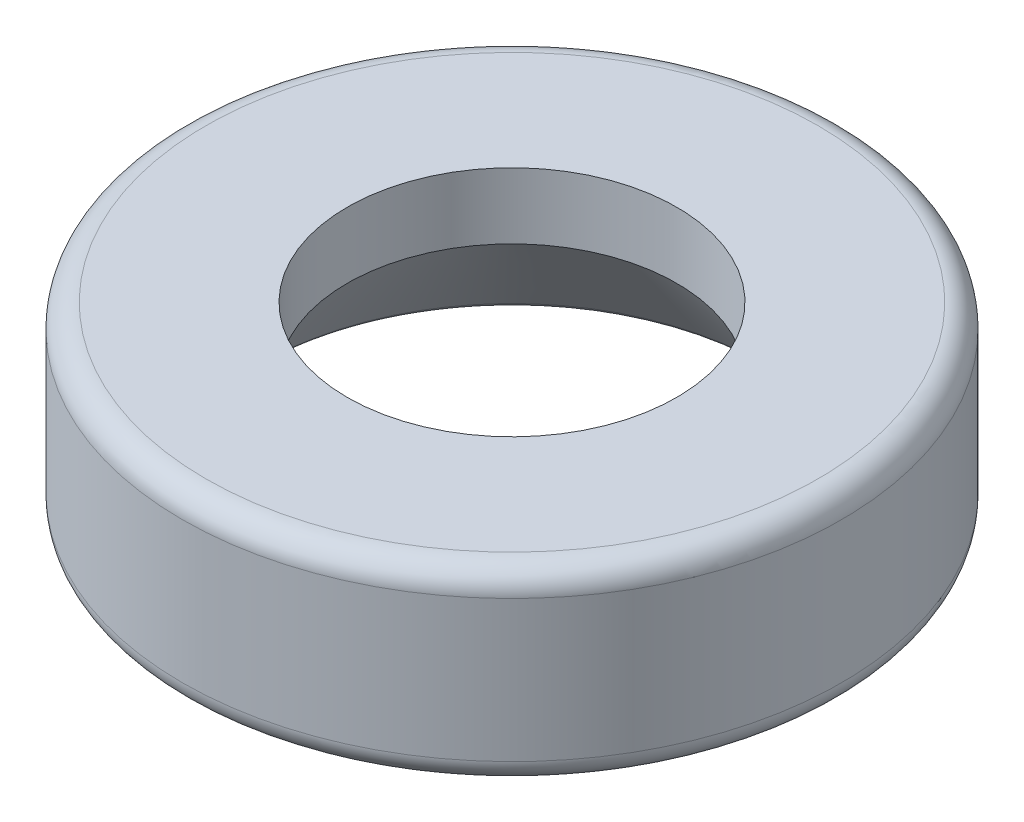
ISO-10303-21;
HEADER;
FILE_DESCRIPTION(('STEP AP214'),'2;1');
FILE_NAME('part.step','',(''),(''),'','','');
FILE_SCHEMA(('AUTOMOTIVE_DESIGN { 1 0 10303 214 1 1 1 1 }'));
ENDSEC;
DATA;
#1=APPLICATION_CONTEXT('core data for automotive mechanical design processes');
#2=APPLICATION_PROTOCOL_DEFINITION('international standard','automotive_design',2000,#1);
#3=PRODUCT_CONTEXT('',#1,'mechanical');
#4=PRODUCT('Part','Part','',(#3));
#5=PRODUCT_RELATED_PRODUCT_CATEGORY('part','',(#4));
#6=PRODUCT_DEFINITION_FORMATION('','',#4);
#7=PRODUCT_DEFINITION_CONTEXT('part definition',#1,'design');
#8=PRODUCT_DEFINITION('design','',#6,#7);
#9=PRODUCT_DEFINITION_SHAPE('','',#8);
#10=(LENGTH_UNIT() NAMED_UNIT(*) SI_UNIT(.MILLI.,.METRE.));
#11=(NAMED_UNIT(*) PLANE_ANGLE_UNIT() SI_UNIT($,.RADIAN.));
#12=(NAMED_UNIT(*) SI_UNIT($,.STERADIAN.) SOLID_ANGLE_UNIT());
#13=UNCERTAINTY_MEASURE_WITH_UNIT(LENGTH_MEASURE(1.E-05),#10,'distance_accuracy_value','');
#14=(GEOMETRIC_REPRESENTATION_CONTEXT(3) GLOBAL_UNCERTAINTY_ASSIGNED_CONTEXT((#13)) GLOBAL_UNIT_ASSIGNED_CONTEXT((#10,
#11,#12)) REPRESENTATION_CONTEXT('',''));
#15=CARTESIAN_POINT('',(0.,0.,0.));
#16=DIRECTION('',(0.,0.,1.));
#17=DIRECTION('',(1.,0.,0.));
#18=AXIS2_PLACEMENT_3D('',#15,#16,#17);
#19=CARTESIAN_POINT('',(0.,70.,0.));
#20=DIRECTION('',(0.,1.,0.));
#21=DIRECTION('',(0.,0.,1.));
#22=AXIS2_PLACEMENT_3D('',#19,#20,#21);
#23=CYLINDRICAL_SURFACE('',#22,7.);
#24=CARTESIAN_POINT('',(0.,0.5,0.));
#25=DIRECTION('',(0.,-1.,0.));
#26=DIRECTION('',(0.,0.,-1.));
#27=AXIS2_PLACEMENT_3D('',#24,#25,#26);
#28=CIRCLE('',#27,7.);
#29=CARTESIAN_POINT('',(0.,0.5,-7.));
#30=VERTEX_POINT('',#29);
#31=EDGE_CURVE('E360',#30,#30,#28,.F.);
#32=ORIENTED_EDGE('',*,*,#31,.T.);
#33=EDGE_LOOP('',(#32));
#34=FACE_BOUND('',#33,.T.);
#35=CARTESIAN_POINT('',(0.,3.5,0.));
#36=DIRECTION('',(0.,1.,0.));
#37=DIRECTION('',(0.,0.,1.));
#38=AXIS2_PLACEMENT_3D('',#35,#36,#37);
#39=CIRCLE('',#38,7.);
#40=CARTESIAN_POINT('',(0.,3.5,7.));
#41=VERTEX_POINT('',#40);
#42=EDGE_CURVE('E364',#41,#41,#39,.F.);
#43=ORIENTED_EDGE('',*,*,#42,.T.);
#44=EDGE_LOOP('',(#43));
#45=FACE_BOUND('',#44,.T.);
#46=ADVANCED_FACE('F354',(#34,#45),#23,.T.);
#47=CARTESIAN_POINT('',(-5.49999999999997,0.,0.));
#48=DIRECTION('',(0.,-1.,0.));
#49=DIRECTION('',(0.,0.,-1.));
#50=AXIS2_PLACEMENT_3D('',#47,#48,#49);
#51=PLANE('',#50);
#52=CARTESIAN_POINT('',(0.,0.,0.));
#53=DIRECTION('',(0.,-1.,0.));
#54=DIRECTION('',(0.,0.,-1.));
#55=AXIS2_PLACEMENT_3D('',#52,#53,#54);
#56=CIRCLE('',#55,5.74620074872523);
#57=CARTESIAN_POINT('',(0.,0.,-5.74620074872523));
#58=VERTEX_POINT('',#57);
#59=EDGE_CURVE('E373',#58,#58,#56,.F.);
#60=ORIENTED_EDGE('',*,*,#59,.T.);
#61=EDGE_LOOP('',(#60));
#62=FACE_BOUND('',#61,.T.);
#63=CARTESIAN_POINT('',(0.,0.,0.));
#64=DIRECTION('',(0.,-1.,0.));
#65=DIRECTION('',(0.,0.,-1.));
#66=AXIS2_PLACEMENT_3D('',#63,#64,#65);
#67=CIRCLE('',#66,6.5);
#68=CARTESIAN_POINT('',(0.,0.,-6.5));
#69=VERTEX_POINT('',#68);
#70=EDGE_CURVE('E376',#69,#69,#67,.T.);
#71=ORIENTED_EDGE('',*,*,#70,.T.);
#72=EDGE_LOOP('',(#71));
#73=FACE_BOUND('',#72,.T.);
#74=ADVANCED_FACE('F404',(#62,#73),#51,.T.);
#75=CARTESIAN_POINT('',(0.,0.,0.));
#76=DIRECTION('',(0.,-1.,0.));
#77=DIRECTION('',(0.,0.,-1.));
#78=AXIS2_PLACEMENT_3D('',#75,#76,#77);
#79=CONICAL_SURFACE('',#78,5.49999999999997,0.65569562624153);
#80=CARTESIAN_POINT('',(0.,0.195144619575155,0.));
#81=DIRECTION('',(0.,1.,0.));
#82=DIRECTION('',(0.,0.,1.));
#83=AXIS2_PLACEMENT_3D('',#80,#81,#82);
#84=CIRCLE('',#83,5.34988875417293);
#85=CARTESIAN_POINT('',(0.,0.195144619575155,5.34988875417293));
#86=VERTEX_POINT('',#85);
#87=EDGE_CURVE('E368',#86,#86,#84,.F.);
#88=ORIENTED_EDGE('',*,*,#87,.T.);
#89=EDGE_LOOP('',(#88));
#90=FACE_BOUND('',#89,.T.);
#91=CARTESIAN_POINT('',(0.,2.6,0.));
#92=DIRECTION('',(0.,1.,0.));
#93=DIRECTION('',(0.,0.,1.));
#94=AXIS2_PLACEMENT_3D('',#91,#92,#93);
#95=CIRCLE('',#94,3.49999999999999);
#96=CARTESIAN_POINT('',(0.,2.6,3.49999999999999));
#97=VERTEX_POINT('',#96);
#98=EDGE_CURVE('E379',#97,#97,#95,.T.);
#99=ORIENTED_EDGE('',*,*,#98,.T.);
#100=EDGE_LOOP('',(#99));
#101=FACE_BOUND('',#100,.T.);
#102=ADVANCED_FACE('F401',(#90,#101),#79,.F.);
#103=CARTESIAN_POINT('',(0.,70.,0.));
#104=DIRECTION('',(0.,1.,0.));
#105=DIRECTION('',(0.,0.,1.));
#106=AXIS2_PLACEMENT_3D('',#103,#104,#105);
#107=CYLINDRICAL_SURFACE('',#106,3.49999999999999);
#108=CARTESIAN_POINT('',(0.,4.,0.));
#109=DIRECTION('',(0.,1.,0.));
#110=DIRECTION('',(0.,0.,1.));
#111=AXIS2_PLACEMENT_3D('',#108,#109,#110);
#112=CIRCLE('',#111,3.49999999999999);
#113=CARTESIAN_POINT('',(0.,4.,3.49999999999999));
#114=VERTEX_POINT('',#113);
#115=EDGE_CURVE('E382',#114,#114,#112,.T.);
#116=ORIENTED_EDGE('',*,*,#115,.T.);
#117=EDGE_LOOP('',(#116));
#118=FACE_BOUND('',#117,.T.);
#119=ORIENTED_EDGE('',*,*,#98,.F.);
#120=EDGE_LOOP('',(#119));
#121=FACE_BOUND('',#120,.T.);
#122=ADVANCED_FACE('F386',(#118,#121),#107,.F.);
#123=CARTESIAN_POINT('',(-7.,4.,0.));
#124=DIRECTION('',(0.,1.,0.));
#125=DIRECTION('',(0.,0.,1.));
#126=AXIS2_PLACEMENT_3D('',#123,#124,#125);
#127=PLANE('',#126);
#128=CARTESIAN_POINT('',(0.,4.,0.));
#129=DIRECTION('',(0.,1.,0.));
#130=DIRECTION('',(0.,0.,1.));
#131=AXIS2_PLACEMENT_3D('',#128,#129,#130);
#132=CIRCLE('',#131,6.5);
#133=CARTESIAN_POINT('',(0.,4.,6.5));
#134=VERTEX_POINT('',#133);
#135=EDGE_CURVE('E10',#134,#134,#132,.T.);
#136=ORIENTED_EDGE('',*,*,#135,.T.);
#137=EDGE_LOOP('',(#136));
#138=FACE_BOUND('',#137,.T.);
#139=ORIENTED_EDGE('',*,*,#115,.F.);
#140=EDGE_LOOP('',(#139));
#141=FACE_BOUND('',#140,.T.);
#142=ADVANCED_FACE('F389',(#138,#141),#127,.T.);
#143=CARTESIAN_POINT('',(0.,0.5,0.));
#144=DIRECTION('',(0.,-1.,0.));
#145=DIRECTION('',(0.,0.,-1.));
#146=AXIS2_PLACEMENT_3D('',#143,#144,#145);
#147=TOROIDAL_SURFACE('',#146,5.74620074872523,0.5);
#148=ORIENTED_EDGE('',*,*,#87,.F.);
#149=EDGE_LOOP('',(#148));
#150=FACE_BOUND('',#149,.T.);
#151=ORIENTED_EDGE('',*,*,#59,.F.);
#152=EDGE_LOOP('',(#151));
#153=FACE_BOUND('',#152,.T.);
#154=ADVANCED_FACE('F391',(#150,#153),#147,.T.);
#155=CARTESIAN_POINT('',(0.,0.5,0.));
#156=DIRECTION('',(0.,-1.,0.));
#157=DIRECTION('',(0.,0.,-1.));
#158=AXIS2_PLACEMENT_3D('',#155,#156,#157);
#159=TOROIDAL_SURFACE('',#158,6.5,0.5);
#160=ORIENTED_EDGE('',*,*,#70,.F.);
#161=EDGE_LOOP('',(#160));
#162=FACE_BOUND('',#161,.T.);
#163=ORIENTED_EDGE('',*,*,#31,.F.);
#164=EDGE_LOOP('',(#163));
#165=FACE_BOUND('',#164,.T.);
#166=ADVANCED_FACE('F397',(#162,#165),#159,.T.);
#167=CARTESIAN_POINT('',(0.,3.5,0.));
#168=DIRECTION('',(0.,1.,0.));
#169=DIRECTION('',(0.,0.,1.));
#170=AXIS2_PLACEMENT_3D('',#167,#168,#169);
#171=TOROIDAL_SURFACE('',#170,6.5,0.5);
#172=ORIENTED_EDGE('',*,*,#42,.F.);
#173=EDGE_LOOP('',(#172));
#174=FACE_BOUND('',#173,.T.);
#175=ORIENTED_EDGE('',*,*,#135,.F.);
#176=EDGE_LOOP('',(#175));
#177=FACE_BOUND('',#176,.T.);
#178=ADVANCED_FACE('F412',(#174,#177),#171,.T.);
#179=CLOSED_SHELL('',(#46,#74,#102,#122,#142,#154,#166,#178));
#180=MANIFOLD_SOLID_BREP('B2',#179);
#181=ADVANCED_BREP_SHAPE_REPRESENTATION('',(#18,#180),#14);
#182=SHAPE_DEFINITION_REPRESENTATION(#9,#181);
ENDSEC;
END-ISO-10303-21;
